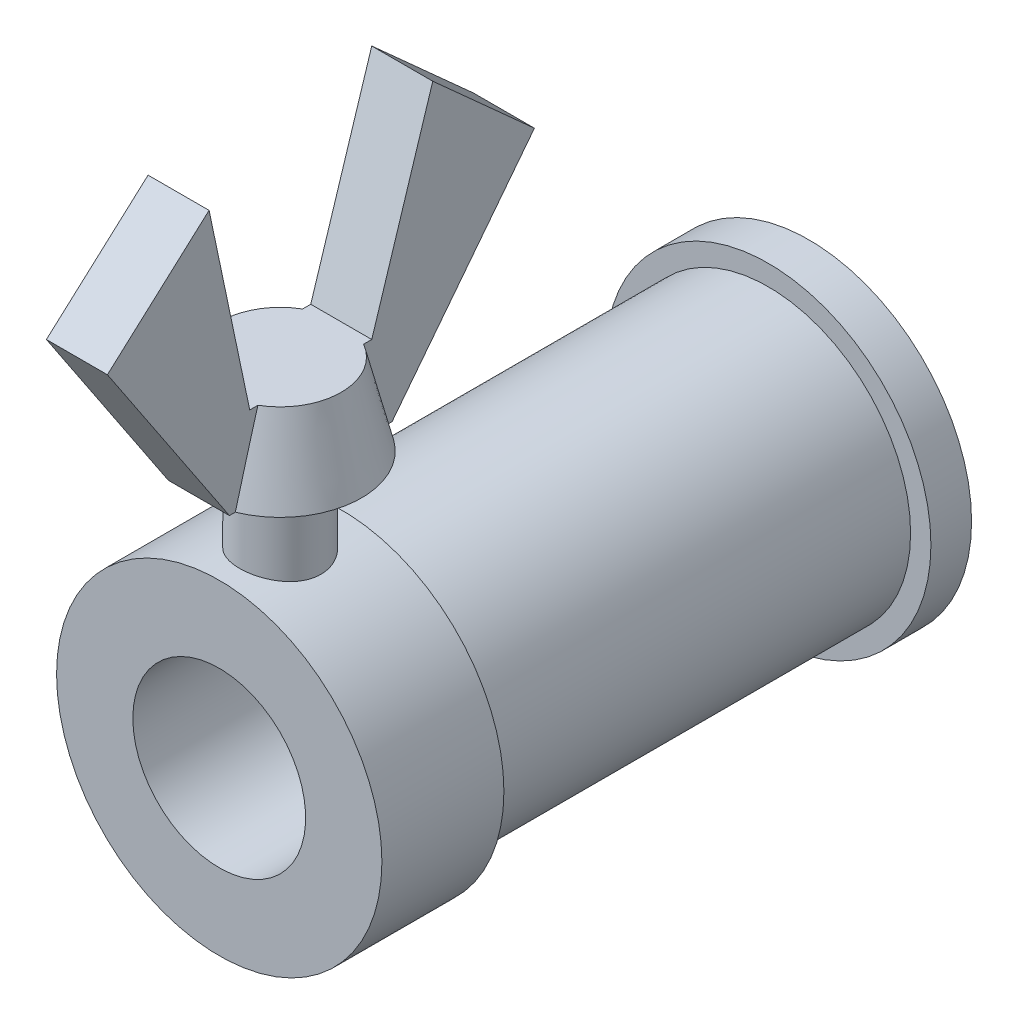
ISO-10303-21;
HEADER;
FILE_DESCRIPTION(('STEP AP214'),'2;1');
FILE_NAME('part.step','',(''),(''),'','','');
FILE_SCHEMA(('AUTOMOTIVE_DESIGN { 1 0 10303 214 1 1 1 1 }'));
ENDSEC;
DATA;
#1=APPLICATION_CONTEXT('core data for automotive mechanical design processes');
#2=APPLICATION_PROTOCOL_DEFINITION('international standard','automotive_design',2000,#1);
#3=PRODUCT_CONTEXT('',#1,'mechanical');
#4=PRODUCT('Part','Part','',(#3));
#5=PRODUCT_RELATED_PRODUCT_CATEGORY('part','',(#4));
#6=PRODUCT_DEFINITION_FORMATION('','',#4);
#7=PRODUCT_DEFINITION_CONTEXT('part definition',#1,'design');
#8=PRODUCT_DEFINITION('design','',#6,#7);
#9=PRODUCT_DEFINITION_SHAPE('','',#8);
#10=(LENGTH_UNIT() NAMED_UNIT(*) SI_UNIT(.MILLI.,.METRE.));
#11=(NAMED_UNIT(*) PLANE_ANGLE_UNIT() SI_UNIT($,.RADIAN.));
#12=(NAMED_UNIT(*) SI_UNIT($,.STERADIAN.) SOLID_ANGLE_UNIT());
#13=UNCERTAINTY_MEASURE_WITH_UNIT(LENGTH_MEASURE(1.E-05),#10,'distance_accuracy_value','');
#14=(GEOMETRIC_REPRESENTATION_CONTEXT(3) GLOBAL_UNCERTAINTY_ASSIGNED_CONTEXT((#13)) GLOBAL_UNIT_ASSIGNED_CONTEXT((#10,
#11,#12)) REPRESENTATION_CONTEXT('',''));
#15=CARTESIAN_POINT('',(0.,0.,0.));
#16=DIRECTION('',(0.,0.,1.));
#17=DIRECTION('',(1.,0.,0.));
#18=AXIS2_PLACEMENT_3D('',#15,#16,#17);
#19=CARTESIAN_POINT('',(0.,16.,26.));
#20=DIRECTION('',(0.,-1.,0.));
#21=DIRECTION('',(0.,0.,1.));
#22=AXIS2_PLACEMENT_3D('',#19,#20,#21);
#23=CONICAL_SURFACE('',#22,3.,0.244978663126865);
#24=CARTESIAN_POINT('',(-1.5,18.8634565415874,27.7225784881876));
#25=CARTESIAN_POINT('',(-1.5,18.7179564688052,27.7707943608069));
#26=CARTESIAN_POINT('',(-1.5,18.5722086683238,27.8182542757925));
#27=CARTESIAN_POINT('',(-1.5,18.2803109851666,27.9119099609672));
#28=CARTESIAN_POINT('',(-1.5,18.13416111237,27.9581057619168));
#29=CARTESIAN_POINT('',(-1.5,17.8415562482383,28.0494799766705));
#30=CARTESIAN_POINT('',(-1.5,17.6951012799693,28.0946584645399));
#31=CARTESIAN_POINT('',(-1.5,17.4019324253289,28.1841702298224));
#32=CARTESIAN_POINT('',(-1.5,17.2552185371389,28.2285035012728));
#33=CARTESIAN_POINT('',(-1.5,16.8148083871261,28.3604319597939));
#34=CARTESIAN_POINT('',(-1.5,16.5207956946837,28.4469706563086));
#35=CARTESIAN_POINT('',(-1.5,15.9321710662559,28.6179995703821));
#36=CARTESIAN_POINT('',(-1.5,15.6375591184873,28.7024897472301));
#37=CARTESIAN_POINT('',(-1.5,15.1572394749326,28.8388644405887));
#38=CARTESIAN_POINT('',(-1.5,14.9716653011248,28.8912200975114));
#39=CARTESIAN_POINT('',(-1.5,14.6003702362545,28.9954030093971));
#40=CARTESIAN_POINT('',(-1.5,14.4146493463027,29.0472302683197));
#41=CARTESIAN_POINT('',(-1.5,13.8572788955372,29.2020403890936));
#42=CARTESIAN_POINT('',(-1.5,13.4854412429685,29.3043460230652));
#43=CARTESIAN_POINT('',(-1.5,12.6318117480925,29.5375328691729));
#44=CARTESIAN_POINT('',(-1.5,12.1498946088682,29.6679546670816));
#45=CARTESIAN_POINT('',(-1.5,11.1856155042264,29.9271461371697));
#46=CARTESIAN_POINT('',(-1.5,10.7032535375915,30.0559158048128));
#47=CARTESIAN_POINT('',(-1.5,9.73827559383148,30.3121964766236));
#48=CARTESIAN_POINT('',(-1.5,9.25565966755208,30.439707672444));
#49=CARTESIAN_POINT('',(-1.5,8.29017561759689,30.6937568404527));
#50=CARTESIAN_POINT('',(-1.5,7.80730749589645,30.8202948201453));
#51=CARTESIAN_POINT('',(-1.5,7.32434773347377,30.9464797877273));
#52=B_SPLINE_CURVE_WITH_KNOTS('',3,(#24,#25,#26,#27,#28,#29,#30,#31,#32,#33,#34,#35,#36,#37,#38,
#39,#40,#41,#42,#43,#44,#45,#46,#47,#48,#49,#50,#51),.UNSPECIFIED.,.F.,.F.,(4,2,2,2,2,2,2,2,2,2,
2,2,2,4),(0.,0.459836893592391,0.919662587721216,1.37945469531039,1.83925004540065,
2.75869016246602,3.67814853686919,4.25660258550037,4.83505229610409,5.99201310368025,
7.4897692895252,8.9875295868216,10.4850581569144,11.982575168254),.UNSPECIFIED.);
#53=CARTESIAN_POINT('',(-1.5,16.,28.5980762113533));
#54=VERTEX_POINT('',#53);
#55=CARTESIAN_POINT('',(-1.5,12.,29.7080992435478));
#56=VERTEX_POINT('',#55);
#57=EDGE_CURVE('E308',#54,#56,#52,.T.);
#58=ORIENTED_EDGE('',*,*,#57,.F.);
#59=CARTESIAN_POINT('',(0.,16.,26.));
#60=DIRECTION('',(0.,-1.,0.));
#61=DIRECTION('',(0.,0.,1.));
#62=AXIS2_PLACEMENT_3D('',#59,#60,#61);
#63=CIRCLE('',#62,3.);
#64=CARTESIAN_POINT('',(-1.5,16.,23.4019237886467));
#65=VERTEX_POINT('',#64);
#66=EDGE_CURVE('E176',#54,#65,#63,.T.);
#67=ORIENTED_EDGE('',*,*,#66,.T.);
#68=CARTESIAN_POINT('',(-1.5,7.32434773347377,21.0535202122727));
#69=CARTESIAN_POINT('',(-1.5,7.80738804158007,21.1797262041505));
#70=CARTESIAN_POINT('',(-1.5,8.29033667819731,21.3062853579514));
#71=CARTESIAN_POINT('',(-1.5,9.25597170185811,21.5603746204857));
#72=CARTESIAN_POINT('',(-1.5,9.73865809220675,21.6879047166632));
#73=CARTESIAN_POINT('',(-1.5,10.7036262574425,21.9441835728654));
#74=CARTESIAN_POINT('',(-1.5,11.1859080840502,22.0729321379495));
#75=CARTESIAN_POINT('',(-1.5,12.1500361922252,22.3320837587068));
#76=CARTESIAN_POINT('',(-1.5,12.6318824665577,22.4624868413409));
#77=CARTESIAN_POINT('',(-1.5,13.5950544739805,22.7255967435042));
#78=CARTESIAN_POINT('',(-1.5,14.0763800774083,22.8583040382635));
#79=CARTESIAN_POINT('',(-1.5,15.038107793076,23.12697047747));
#80=CARTESIAN_POINT('',(-1.5,15.5185099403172,23.2629294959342));
#81=CARTESIAN_POINT('',(-1.5,16.2380729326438,23.4706495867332));
#82=CARTESIAN_POINT('',(-1.5,16.4777770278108,23.5405268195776));
#83=CARTESIAN_POINT('',(-1.5,16.9567027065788,23.6819038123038));
#84=CARTESIAN_POINT('',(-1.5,17.1959242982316,23.7534035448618));
#85=CARTESIAN_POINT('',(-1.5,17.6737573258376,23.898533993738));
#86=CARTESIAN_POINT('',(-1.5,17.9123686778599,23.972164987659));
#87=CARTESIAN_POINT('',(-1.5,18.2696087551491,24.0847837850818));
#88=CARTESIAN_POINT('',(-1.5,18.3885793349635,24.1226865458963));
#89=CARTESIAN_POINT('',(-1.5,18.62624120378,24.199363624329));
#90=CARTESIAN_POINT('',(-1.5,18.7449324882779,24.2381379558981));
#91=CARTESIAN_POINT('',(-1.5,18.8634565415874,24.2774215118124));
#92=B_SPLINE_CURVE_WITH_KNOTS('',3,(#68,#69,#70,#71,#72,#73,#74,#75,#76,#77,#78,#79,#80,#81,#82,
#83,#84,#85,#86,#87,#88,#89,#90,#91),.UNSPECIFIED.,.F.,.F.,(4,2,2,2,2,2,2,2,2,2,2,4),(0.,
1.49776676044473,2.99551418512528,4.49302590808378,5.99056206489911,7.48841083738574,
8.98620167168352,9.73524200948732,10.4842697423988,11.2333954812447,11.6079796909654,
11.9825699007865),.UNSPECIFIED.);
#93=CARTESIAN_POINT('',(-1.5,12.,22.2919007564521));
#94=VERTEX_POINT('',#93);
#95=EDGE_CURVE('E205',#94,#65,#92,.T.);
#96=ORIENTED_EDGE('',*,*,#95,.F.);
#97=CARTESIAN_POINT('',(0.,12.,26.));
#98=DIRECTION('',(0.,-1.,0.));
#99=DIRECTION('',(0.,0.,1.));
#100=AXIS2_PLACEMENT_3D('',#97,#98,#99);
#101=CIRCLE('',#100,4.);
#102=EDGE_CURVE('E174',#56,#94,#101,.T.);
#103=ORIENTED_EDGE('',*,*,#102,.F.);
#104=EDGE_LOOP('',(#58,#67,#96,#103));
#105=FACE_BOUND('',#104,.T.);
#106=ADVANCED_FACE('F14',(#105),#23,.T.);
#107=CARTESIAN_POINT('',(-8.,0.,0.));
#108=DIRECTION('',(0.,0.,1.));
#109=DIRECTION('',(1.,0.,0.));
#110=AXIS2_PLACEMENT_3D('',#107,#108,#109);
#111=PLANE('',#110);
#112=CARTESIAN_POINT('',(0.,0.,0.));
#113=DIRECTION('',(0.,0.,-1.));
#114=DIRECTION('',(-1.,0.,0.));
#115=AXIS2_PLACEMENT_3D('',#112,#113,#114);
#116=CIRCLE('',#115,4.25);
#117=CARTESIAN_POINT('',(-4.25,0.,0.));
#118=VERTEX_POINT('',#117);
#119=EDGE_CURVE('E181',#118,#118,#116,.T.);
#120=ORIENTED_EDGE('',*,*,#119,.F.);
#121=EDGE_LOOP('',(#120));
#122=FACE_BOUND('',#121,.T.);
#123=CARTESIAN_POINT('',(0.,0.,0.));
#124=DIRECTION('',(0.,0.,-1.));
#125=DIRECTION('',(-1.,0.,0.));
#126=AXIS2_PLACEMENT_3D('',#123,#124,#125);
#127=CIRCLE('',#126,8.);
#128=CARTESIAN_POINT('',(-8.,0.,0.));
#129=VERTEX_POINT('',#128);
#130=EDGE_CURVE('E202',#129,#129,#127,.T.);
#131=ORIENTED_EDGE('',*,*,#130,.T.);
#132=EDGE_LOOP('',(#131));
#133=FACE_BOUND('',#132,.T.);
#134=ADVANCED_FACE('F16',(#122,#133),#111,.F.);
#135=CARTESIAN_POINT('',(0.,0.,-31.));
#136=DIRECTION('',(0.,0.,-1.));
#137=DIRECTION('',(-1.,0.,0.));
#138=AXIS2_PLACEMENT_3D('',#135,#136,#137);
#139=CYLINDRICAL_SURFACE('',#138,8.);
#140=ORIENTED_EDGE('',*,*,#130,.F.);
#141=EDGE_LOOP('',(#140));
#142=FACE_BOUND('',#141,.T.);
#143=CARTESIAN_POINT('',(0.,0.,2.));
#144=DIRECTION('',(0.,0.,-1.));
#145=DIRECTION('',(-1.,0.,0.));
#146=AXIS2_PLACEMENT_3D('',#143,#144,#145);
#147=CIRCLE('',#146,8.);
#148=CARTESIAN_POINT('',(-8.,0.,2.));
#149=VERTEX_POINT('',#148);
#150=EDGE_CURVE('E199',#149,#149,#147,.T.);
#151=ORIENTED_EDGE('',*,*,#150,.T.);
#152=EDGE_LOOP('',(#151));
#153=FACE_BOUND('',#152,.T.);
#154=ADVANCED_FACE('F254',(#142,#153),#139,.T.);
#155=CARTESIAN_POINT('',(-7.,0.,2.));
#156=DIRECTION('',(0.,0.,-1.));
#157=DIRECTION('',(-1.,0.,0.));
#158=AXIS2_PLACEMENT_3D('',#155,#156,#157);
#159=PLANE('',#158);
#160=ORIENTED_EDGE('',*,*,#150,.F.);
#161=EDGE_LOOP('',(#160));
#162=FACE_BOUND('',#161,.T.);
#163=CARTESIAN_POINT('',(0.,0.,2.));
#164=DIRECTION('',(0.,0.,-1.));
#165=DIRECTION('',(-1.,0.,0.));
#166=AXIS2_PLACEMENT_3D('',#163,#164,#165);
#167=CIRCLE('',#166,7.);
#168=CARTESIAN_POINT('',(-7.,0.,2.));
#169=VERTEX_POINT('',#168);
#170=EDGE_CURVE('E196',#169,#169,#167,.T.);
#171=ORIENTED_EDGE('',*,*,#170,.T.);
#172=EDGE_LOOP('',(#171));
#173=FACE_BOUND('',#172,.T.);
#174=ADVANCED_FACE('F434',(#162,#173),#159,.F.);
#175=CARTESIAN_POINT('',(0.,0.,-31.));
#176=DIRECTION('',(0.,0.,-1.));
#177=DIRECTION('',(-1.,0.,0.));
#178=AXIS2_PLACEMENT_3D('',#175,#176,#177);
#179=CYLINDRICAL_SURFACE('',#178,7.);
#180=ORIENTED_EDGE('',*,*,#170,.F.);
#181=EDGE_LOOP('',(#180));
#182=FACE_BOUND('',#181,.T.);
#183=CARTESIAN_POINT('',(0.,0.,23.));
#184=DIRECTION('',(0.,0.,-1.));
#185=DIRECTION('',(-1.,0.,0.));
#186=AXIS2_PLACEMENT_3D('',#183,#184,#185);
#187=CIRCLE('',#186,7.);
#188=CARTESIAN_POINT('',(-7.,0.,23.));
#189=VERTEX_POINT('',#188);
#190=EDGE_CURVE('E193',#189,#189,#187,.T.);
#191=ORIENTED_EDGE('',*,*,#190,.T.);
#192=EDGE_LOOP('',(#191));
#193=FACE_BOUND('',#192,.T.);
#194=ADVANCED_FACE('F425',(#182,#193),#179,.T.);
#195=CARTESIAN_POINT('',(-8.,0.,23.));
#196=DIRECTION('',(0.,0.,1.));
#197=DIRECTION('',(1.,0.,0.));
#198=AXIS2_PLACEMENT_3D('',#195,#196,#197);
#199=PLANE('',#198);
#200=ORIENTED_EDGE('',*,*,#190,.F.);
#201=EDGE_LOOP('',(#200));
#202=FACE_BOUND('',#201,.T.);
#203=CARTESIAN_POINT('',(0.,0.,23.));
#204=DIRECTION('',(0.,0.,-1.));
#205=DIRECTION('',(-1.,0.,0.));
#206=AXIS2_PLACEMENT_3D('',#203,#204,#205);
#207=CIRCLE('',#206,8.);
#208=CARTESIAN_POINT('',(-8.,0.,23.));
#209=VERTEX_POINT('',#208);
#210=EDGE_CURVE('E190',#209,#209,#207,.T.);
#211=ORIENTED_EDGE('',*,*,#210,.T.);
#212=EDGE_LOOP('',(#211));
#213=FACE_BOUND('',#212,.T.);
#214=ADVANCED_FACE('F244',(#202,#213),#199,.F.);
#215=CARTESIAN_POINT('',(0.,0.,-31.));
#216=DIRECTION('',(0.,0.,-1.));
#217=DIRECTION('',(-1.,0.,0.));
#218=AXIS2_PLACEMENT_3D('',#215,#216,#217);
#219=CYLINDRICAL_SURFACE('',#218,8.);
#220=CARTESIAN_POINT('',(0.,8.,28.));
#221=CARTESIAN_POINT('',(-0.110501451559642,7.99999813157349,27.9999968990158));
#222=CARTESIAN_POINT('',(-0.221037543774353,7.99768770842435,27.990811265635));
#223=CARTESIAN_POINT('',(-0.438941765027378,7.98869485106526,27.954366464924));
#224=CARTESIAN_POINT('',(-0.546308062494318,7.98200993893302,27.9270970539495));
#225=CARTESIAN_POINT('',(-0.754694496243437,7.96500835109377,27.8554143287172));
#226=CARTESIAN_POINT('',(-0.855722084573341,7.95469603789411,27.811021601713));
#227=CARTESIAN_POINT('',(-1.04889617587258,7.93153791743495,27.7064248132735));
#228=CARTESIAN_POINT('',(-1.14104237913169,7.91869202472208,27.646220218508));
#229=CARTESIAN_POINT('',(-1.31573590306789,7.89156551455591,27.5103989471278));
#230=CARTESIAN_POINT('',(-1.39807425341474,7.87726276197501,27.4345179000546));
#231=CARTESIAN_POINT('',(-1.54899856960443,7.84898160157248,27.270063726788));
#232=CARTESIAN_POINT('',(-1.61758298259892,7.83500323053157,27.1814891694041));
#233=CARTESIAN_POINT('',(-1.74003539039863,7.80873034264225,26.992539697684));
#234=CARTESIAN_POINT('',(-1.79366962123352,7.79646392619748,26.8920090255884));
#235=CARTESIAN_POINT('',(-1.88319587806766,7.77532659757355,26.6830021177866));
#236=CARTESIAN_POINT('',(-1.91909074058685,7.76645514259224,26.5745271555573));
#237=CARTESIAN_POINT('',(-1.97140644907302,7.7533396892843,26.3550086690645));
#238=CARTESIAN_POINT('',(-1.98820302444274,7.74900654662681,26.244060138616));
#239=CARTESIAN_POINT('',(-2.00301570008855,7.74519149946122,26.0208419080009));
#240=CARTESIAN_POINT('',(-2.00103485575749,7.74570880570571,25.9085724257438));
#241=CARTESIAN_POINT('',(-1.97864869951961,7.75145607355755,25.6887789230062));
#242=CARTESIAN_POINT('',(-1.95869112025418,7.75657150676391,25.5812058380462));
#243=CARTESIAN_POINT('',(-1.90163224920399,7.77075612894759,25.3709852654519));
#244=CARTESIAN_POINT('',(-1.86452973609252,7.77982559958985,25.2683381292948));
#245=CARTESIAN_POINT('',(-1.77385263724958,7.80100151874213,25.0696826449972));
#246=CARTESIAN_POINT('',(-1.72011555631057,7.81313769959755,24.9737517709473));
#247=CARTESIAN_POINT('',(-1.59780836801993,7.83906281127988,24.7921083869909));
#248=CARTESIAN_POINT('',(-1.52923566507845,7.85285203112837,24.7063976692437));
#249=CARTESIAN_POINT('',(-1.37688456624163,7.88101174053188,24.5450618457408));
#250=CARTESIAN_POINT('',(-1.29272834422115,7.89538759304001,24.4697940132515));
#251=CARTESIAN_POINT('',(-1.11281589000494,7.92274620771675,24.3343716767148));
#252=CARTESIAN_POINT('',(-1.01705930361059,7.93572892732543,24.2742176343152));
#253=CARTESIAN_POINT('',(-0.816154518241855,7.9589030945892,24.1705992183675));
#254=CARTESIAN_POINT('',(-0.710975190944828,7.96908480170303,24.1271928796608));
#255=CARTESIAN_POINT('',(-0.494501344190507,7.98543889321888,24.0587769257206));
#256=CARTESIAN_POINT('',(-0.383207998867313,7.99161204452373,24.0337637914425));
#257=CARTESIAN_POINT('',(-0.160719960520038,7.999139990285,24.0033899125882));
#258=CARTESIAN_POINT('',(-0.049595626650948,8.00061404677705,23.9975426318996));
#259=CARTESIAN_POINT('',(0.172043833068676,7.99891739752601,24.0043320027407));
#260=CARTESIAN_POINT('',(0.282559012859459,7.99574710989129,24.0169669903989));
#261=CARTESIAN_POINT('',(0.498152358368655,7.98519441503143,24.0599612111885));
#262=CARTESIAN_POINT('',(0.603286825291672,7.97787512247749,24.0900550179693));
#263=CARTESIAN_POINT('',(0.807009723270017,7.95984942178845,24.1668094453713));
#264=CARTESIAN_POINT('',(0.905597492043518,7.94914267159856,24.2134717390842));
#265=CARTESIAN_POINT('',(1.0953641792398,7.92524410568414,24.3229815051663));
#266=CARTESIAN_POINT('',(1.18638058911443,7.91201156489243,24.3861014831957));
#267=CARTESIAN_POINT('',(1.35670215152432,7.88459345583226,24.5263865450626));
#268=CARTESIAN_POINT('',(1.43600527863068,7.87040772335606,24.6035540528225));
#269=CARTESIAN_POINT('',(1.58265409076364,7.84225275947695,24.7720026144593));
#270=CARTESIAN_POINT('',(1.6496584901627,7.82829738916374,24.8635836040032));
#271=CARTESIAN_POINT('',(1.76734767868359,7.80257171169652,25.0569768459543));
#272=CARTESIAN_POINT('',(1.81803319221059,7.79080130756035,25.1587886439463));
#273=CARTESIAN_POINT('',(1.90126856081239,7.77090792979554,25.3692076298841));
#274=CARTESIAN_POINT('',(1.93392586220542,7.76276340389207,25.4777701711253));
#275=CARTESIAN_POINT('',(1.98046087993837,7.75102325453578,25.6990795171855));
#276=CARTESIAN_POINT('',(1.99434270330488,7.74742663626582,25.8118254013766));
#277=CARTESIAN_POINT('',(2.00271812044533,7.74526534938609,26.0348280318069));
#278=CARTESIAN_POINT('',(1.99775719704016,7.74655910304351,26.145063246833));
#279=CARTESIAN_POINT('',(1.96983637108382,7.7537054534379,26.3630718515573));
#280=CARTESIAN_POINT('',(1.94687683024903,7.75955795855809,26.4708452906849));
#281=CARTESIAN_POINT('',(1.88390842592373,7.77508347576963,26.6802779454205));
#282=CARTESIAN_POINT('',(1.84400187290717,7.78473353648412,26.7819697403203));
#283=CARTESIAN_POINT('',(1.7483532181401,7.80677007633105,26.9772871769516));
#284=CARTESIAN_POINT('',(1.69260892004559,7.81915693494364,27.0709116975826));
#285=CARTESIAN_POINT('',(1.56515699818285,7.84567512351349,27.2500728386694));
#286=CARTESIAN_POINT('',(1.493070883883,7.85984353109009,27.3353347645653));
#287=CARTESIAN_POINT('',(1.33571916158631,7.88810702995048,27.4927293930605));
#288=CARTESIAN_POINT('',(1.25045042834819,7.90220210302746,27.564858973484));
#289=CARTESIAN_POINT('',(1.06729011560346,7.9290354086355,27.6952150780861));
#290=CARTESIAN_POINT('',(0.969197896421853,7.94174444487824,27.7531661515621));
#291=CARTESIAN_POINT('',(0.764354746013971,7.96406566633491,27.8516632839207));
#292=CARTESIAN_POINT('',(0.657610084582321,7.97368006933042,27.892221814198));
#293=CARTESIAN_POINT('',(0.459213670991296,7.98730746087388,27.9487624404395));
#294=CARTESIAN_POINT('',(0.368506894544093,7.9920344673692,27.9679349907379));
#295=CARTESIAN_POINT('',(0.185208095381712,7.99838140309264,27.9935545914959));
#296=CARTESIAN_POINT('',(0.0926162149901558,8.00000156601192,28.0000025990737));
#297=CARTESIAN_POINT('',(0.,8.,28.));
#298=B_SPLINE_CURVE_WITH_KNOTS('',3,(#220,#221,#222,#223,#224,#225,#226,#227,#228,#229,#230,
#231,#232,#233,#234,#235,#236,#237,#238,#239,#240,#241,#242,#243,#244,#245,#246,#247,#248,#249,
#250,#251,#252,#253,#254,#255,#256,#257,#258,#259,#260,#261,#262,#263,#264,#265,#266,#267,#268,
#269,#270,#271,#272,#273,#274,#275,#276,#277,#278,#279,#280,#281,#282,#283,#284,#285,#286,#287,
#288,#289,#290,#291,#292,#293,#294,#295,#296,#297),.UNSPECIFIED.,.T.,.F.,(4,2,2,2,2,2,2,2,2,2,2,
2,2,2,2,2,2,2,2,2,2,2,2,2,2,2,2,2,2,2,2,2,2,2,2,2,2,2,4),(0.,0.331164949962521,0.66251765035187,
0.993473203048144,1.32443992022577,1.66152580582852,1.99864972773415,2.34078196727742,
2.68285948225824,3.01808393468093,3.3532538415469,3.68029996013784,4.00736937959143,
4.33774037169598,4.6681692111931,5.00802001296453,5.34788119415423,5.6889097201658,
6.02987298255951,6.36211078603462,6.69431868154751,7.02160366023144,7.34892169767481,
7.68204783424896,8.01523150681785,8.35659345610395,8.6979402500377,9.03723006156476,
9.37644564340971,9.70591707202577,10.0353818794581,10.3628853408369,10.6904342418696,
11.0265276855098,11.3627009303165,11.7049624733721,12.0469781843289,12.3245632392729,
12.6021274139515),.UNSPECIFIED.);
#299=CARTESIAN_POINT('',(0.,8.,28.));
#300=VERTEX_POINT('',#299);
#301=EDGE_CURVE('E180',#300,#300,#298,.T.);
#302=ORIENTED_EDGE('',*,*,#301,.T.);
#303=EDGE_LOOP('',(#302));
#304=FACE_BOUND('',#303,.T.);
#305=ORIENTED_EDGE('',*,*,#210,.F.);
#306=EDGE_LOOP('',(#305));
#307=FACE_BOUND('',#306,.T.);
#308=CARTESIAN_POINT('',(0.,0.,29.));
#309=DIRECTION('',(0.,0.,-1.));
#310=DIRECTION('',(-1.,0.,0.));
#311=AXIS2_PLACEMENT_3D('',#308,#309,#310);
#312=CIRCLE('',#311,8.);
#313=CARTESIAN_POINT('',(-8.,0.,29.));
#314=VERTEX_POINT('',#313);
#315=EDGE_CURVE('E187',#314,#314,#312,.T.);
#316=ORIENTED_EDGE('',*,*,#315,.T.);
#317=EDGE_LOOP('',(#316));
#318=FACE_BOUND('',#317,.T.);
#319=ADVANCED_FACE('F219',(#304,#307,#318),#219,.T.);
#320=CARTESIAN_POINT('',(-4.25,0.,29.));
#321=DIRECTION('',(0.,0.,-1.));
#322=DIRECTION('',(-1.,0.,0.));
#323=AXIS2_PLACEMENT_3D('',#320,#321,#322);
#324=PLANE('',#323);
#325=ORIENTED_EDGE('',*,*,#315,.F.);
#326=EDGE_LOOP('',(#325));
#327=FACE_BOUND('',#326,.T.);
#328=CARTESIAN_POINT('',(0.,0.,29.));
#329=DIRECTION('',(0.,0.,-1.));
#330=DIRECTION('',(-1.,0.,0.));
#331=AXIS2_PLACEMENT_3D('',#328,#329,#330);
#332=CIRCLE('',#331,4.25);
#333=CARTESIAN_POINT('',(-4.25,0.,29.));
#334=VERTEX_POINT('',#333);
#335=EDGE_CURVE('E184',#334,#334,#332,.T.);
#336=ORIENTED_EDGE('',*,*,#335,.T.);
#337=EDGE_LOOP('',(#336));
#338=FACE_BOUND('',#337,.T.);
#339=ADVANCED_FACE('F236',(#327,#338),#324,.F.);
#340=CARTESIAN_POINT('',(0.,0.,-31.));
#341=DIRECTION('',(0.,0.,-1.));
#342=DIRECTION('',(-1.,0.,0.));
#343=AXIS2_PLACEMENT_3D('',#340,#341,#342);
#344=CYLINDRICAL_SURFACE('',#343,4.25);
#345=ORIENTED_EDGE('',*,*,#335,.F.);
#346=EDGE_LOOP('',(#345));
#347=FACE_BOUND('',#346,.T.);
#348=ORIENTED_EDGE('',*,*,#119,.T.);
#349=EDGE_LOOP('',(#348));
#350=FACE_BOUND('',#349,.T.);
#351=ADVANCED_FACE('F229',(#347,#350),#344,.F.);
#352=CARTESIAN_POINT('',(0.,-40.,26.));
#353=DIRECTION('',(0.,-1.,0.));
#354=DIRECTION('',(0.,0.,1.));
#355=AXIS2_PLACEMENT_3D('',#352,#353,#354);
#356=CYLINDRICAL_SURFACE('',#355,2.);
#357=CARTESIAN_POINT('',(0.,12.,26.));
#358=DIRECTION('',(0.,-1.,0.));
#359=DIRECTION('',(0.,0.,1.));
#360=AXIS2_PLACEMENT_3D('',#357,#358,#359);
#361=CIRCLE('',#360,2.);
#362=CARTESIAN_POINT('',(0.,12.,28.));
#363=VERTEX_POINT('',#362);
#364=EDGE_CURVE('E177',#363,#363,#361,.T.);
#365=ORIENTED_EDGE('',*,*,#364,.T.);
#366=EDGE_LOOP('',(#365));
#367=FACE_BOUND('',#366,.T.);
#368=ORIENTED_EDGE('',*,*,#301,.F.);
#369=EDGE_LOOP('',(#368));
#370=FACE_BOUND('',#369,.T.);
#371=ADVANCED_FACE('F223',(#367,#370),#356,.T.);
#372=CARTESIAN_POINT('',(0.,12.,22.));
#373=DIRECTION('',(0.,1.,0.));
#374=DIRECTION('',(0.,0.,-1.));
#375=AXIS2_PLACEMENT_3D('',#372,#373,#374);
#376=PLANE('',#375);
#377=ORIENTED_EDGE('',*,*,#364,.F.);
#378=EDGE_LOOP('',(#377));
#379=FACE_BOUND('',#378,.T.);
#380=CARTESIAN_POINT('',(1.5,12.,22.2919007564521));
#381=VERTEX_POINT('',#380);
#382=CARTESIAN_POINT('',(1.5,12.,29.7080992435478));
#383=VERTEX_POINT('',#382);
#384=EDGE_CURVE('E116',#381,#383,#101,.T.);
#385=ORIENTED_EDGE('',*,*,#384,.T.);
#386=DIRECTION('',(0.,0.,1.));
#387=VECTOR('',#386,1.);
#388=CARTESIAN_POINT('',(1.5,12.,22.));
#389=LINE('',#388,#387);
#390=CARTESIAN_POINT('',(1.5,12.,30.));
#391=VERTEX_POINT('',#390);
#392=EDGE_CURVE('E132',#383,#391,#389,.T.);
#393=ORIENTED_EDGE('',*,*,#392,.T.);
#394=DIRECTION('',(1.,0.,0.));
#395=VECTOR('',#394,1.);
#396=CARTESIAN_POINT('',(-1.5,12.,30.));
#397=LINE('',#396,#395);
#398=CARTESIAN_POINT('',(-1.5,12.,30.));
#399=VERTEX_POINT('',#398);
#400=EDGE_CURVE('E167',#399,#391,#397,.T.);
#401=ORIENTED_EDGE('',*,*,#400,.F.);
#402=DIRECTION('',(0.,0.,1.));
#403=VECTOR('',#402,1.);
#404=CARTESIAN_POINT('',(-1.5,12.,22.));
#405=LINE('',#404,#403);
#406=EDGE_CURVE('E152',#56,#399,#405,.T.);
#407=ORIENTED_EDGE('',*,*,#406,.F.);
#408=ORIENTED_EDGE('',*,*,#102,.T.);
#409=CARTESIAN_POINT('',(-1.5,12.,22.));
#410=VERTEX_POINT('',#409);
#411=EDGE_CURVE('E149',#410,#94,#405,.T.);
#412=ORIENTED_EDGE('',*,*,#411,.F.);
#413=DIRECTION('',(1.,0.,0.));
#414=VECTOR('',#413,1.);
#415=CARTESIAN_POINT('',(-1.5,12.,22.));
#416=LINE('',#415,#414);
#417=CARTESIAN_POINT('',(1.5,12.,22.));
#418=VERTEX_POINT('',#417);
#419=EDGE_CURVE('E169',#410,#418,#416,.T.);
#420=ORIENTED_EDGE('',*,*,#419,.T.);
#421=EDGE_CURVE('E283',#418,#381,#389,.T.);
#422=ORIENTED_EDGE('',*,*,#421,.T.);
#423=EDGE_LOOP('',(#385,#393,#401,#407,#408,#412,#420,#422));
#424=FACE_BOUND('',#423,.T.);
#425=ADVANCED_FACE('F228',(#379,#424),#376,.F.);
#426=CARTESIAN_POINT('',(0.,16.,23.));
#427=DIRECTION('',(0.,1.,0.));
#428=DIRECTION('',(0.,0.,-1.));
#429=AXIS2_PLACEMENT_3D('',#426,#427,#428);
#430=PLANE('',#429);
#431=CARTESIAN_POINT('',(1.5,16.,23.4019237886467));
#432=VERTEX_POINT('',#431);
#433=CARTESIAN_POINT('',(1.5,16.,28.5980762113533));
#434=VERTEX_POINT('',#433);
#435=EDGE_CURVE('E34',#432,#434,#63,.T.);
#436=ORIENTED_EDGE('',*,*,#435,.F.);
#437=DIRECTION('',(0.,0.,1.));
#438=VECTOR('',#437,1.);
#439=CARTESIAN_POINT('',(1.5,16.,23.));
#440=LINE('',#439,#438);
#441=CARTESIAN_POINT('',(1.5,16.,23.));
#442=VERTEX_POINT('',#441);
#443=EDGE_CURVE('E159',#442,#432,#440,.T.);
#444=ORIENTED_EDGE('',*,*,#443,.F.);
#445=DIRECTION('',(1.,0.,0.));
#446=VECTOR('',#445,1.);
#447=CARTESIAN_POINT('',(-1.5,16.,23.));
#448=LINE('',#447,#446);
#449=CARTESIAN_POINT('',(-1.5,16.,23.));
#450=VERTEX_POINT('',#449);
#451=EDGE_CURVE('E122',#450,#442,#448,.T.);
#452=ORIENTED_EDGE('',*,*,#451,.F.);
#453=DIRECTION('',(0.,0.,1.));
#454=VECTOR('',#453,1.);
#455=CARTESIAN_POINT('',(-1.5,16.,23.));
#456=LINE('',#455,#454);
#457=EDGE_CURVE('E136',#450,#65,#456,.T.);
#458=ORIENTED_EDGE('',*,*,#457,.T.);
#459=ORIENTED_EDGE('',*,*,#66,.F.);
#460=CARTESIAN_POINT('',(-1.5,16.,29.));
#461=VERTEX_POINT('',#460);
#462=EDGE_CURVE('E139',#54,#461,#456,.T.);
#463=ORIENTED_EDGE('',*,*,#462,.T.);
#464=DIRECTION('',(1.,0.,0.));
#465=VECTOR('',#464,1.);
#466=CARTESIAN_POINT('',(-1.5,16.,29.));
#467=LINE('',#466,#465);
#468=CARTESIAN_POINT('',(1.5,16.,29.));
#469=VERTEX_POINT('',#468);
#470=EDGE_CURVE('E161',#461,#469,#467,.T.);
#471=ORIENTED_EDGE('',*,*,#470,.T.);
#472=EDGE_CURVE('E271',#434,#469,#440,.T.);
#473=ORIENTED_EDGE('',*,*,#472,.F.);
#474=EDGE_LOOP('',(#436,#444,#452,#458,#459,#463,#471,#473));
#475=FACE_BOUND('',#474,.T.);
#476=ADVANCED_FACE('F231',(#475),#430,.T.);
#477=ORIENTED_EDGE('',*,*,#435,.T.);
#478=CARTESIAN_POINT('',(1.5,18.8634565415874,27.7225784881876));
#479=CARTESIAN_POINT('',(1.5,18.7179564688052,27.7707943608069));
#480=CARTESIAN_POINT('',(1.5,18.5722086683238,27.8182542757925));
#481=CARTESIAN_POINT('',(1.5,18.2803109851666,27.9119099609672));
#482=CARTESIAN_POINT('',(1.5,18.13416111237,27.9581057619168));
#483=CARTESIAN_POINT('',(1.5,17.8415562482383,28.0494799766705));
#484=CARTESIAN_POINT('',(1.5,17.6951012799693,28.0946584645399));
#485=CARTESIAN_POINT('',(1.5,17.4019324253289,28.1841702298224));
#486=CARTESIAN_POINT('',(1.5,17.2552185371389,28.2285035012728));
#487=CARTESIAN_POINT('',(1.5,16.8148083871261,28.3604319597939));
#488=CARTESIAN_POINT('',(1.5,16.5207956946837,28.4469706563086));
#489=CARTESIAN_POINT('',(1.5,15.9321710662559,28.6179995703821));
#490=CARTESIAN_POINT('',(1.5,15.6375591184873,28.7024897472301));
#491=CARTESIAN_POINT('',(1.5,15.1572394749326,28.8388644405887));
#492=CARTESIAN_POINT('',(1.5,14.9716653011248,28.8912200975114));
#493=CARTESIAN_POINT('',(1.5,14.6003702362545,28.9954030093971));
#494=CARTESIAN_POINT('',(1.5,14.4146493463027,29.0472302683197));
#495=CARTESIAN_POINT('',(1.5,13.8572788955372,29.2020403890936));
#496=CARTESIAN_POINT('',(1.5,13.4854412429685,29.3043460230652));
#497=CARTESIAN_POINT('',(1.5,12.6318117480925,29.5375328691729));
#498=CARTESIAN_POINT('',(1.5,12.1498946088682,29.6679546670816));
#499=CARTESIAN_POINT('',(1.5,11.1856155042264,29.9271461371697));
#500=CARTESIAN_POINT('',(1.5,10.7032535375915,30.0559158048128));
#501=CARTESIAN_POINT('',(1.5,9.73827559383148,30.3121964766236));
#502=CARTESIAN_POINT('',(1.5,9.25565966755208,30.439707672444));
#503=CARTESIAN_POINT('',(1.5,8.29017561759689,30.6937568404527));
#504=CARTESIAN_POINT('',(1.5,7.80730749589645,30.8202948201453));
#505=CARTESIAN_POINT('',(1.5,7.32434773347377,30.9464797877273));
#506=B_SPLINE_CURVE_WITH_KNOTS('',3,(#478,#479,#480,#481,#482,#483,#484,#485,#486,#487,#488,
#489,#490,#491,#492,#493,#494,#495,#496,#497,#498,#499,#500,#501,#502,#503,#504,#505),
.UNSPECIFIED.,.F.,.F.,(4,2,2,2,2,2,2,2,2,2,2,2,2,4),(0.,0.459836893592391,0.919662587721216,
1.37945469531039,1.83925004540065,2.75869016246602,3.67814853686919,4.25660258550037,
4.83505229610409,5.99201310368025,7.4897692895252,8.9875295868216,10.4850581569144,
11.982575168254),.UNSPECIFIED.);
#507=EDGE_CURVE('E9',#434,#383,#506,.T.);
#508=ORIENTED_EDGE('',*,*,#507,.T.);
#509=ORIENTED_EDGE('',*,*,#384,.F.);
#510=CARTESIAN_POINT('',(1.5,7.32434773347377,21.0535202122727));
#511=CARTESIAN_POINT('',(1.5,7.80738804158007,21.1797262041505));
#512=CARTESIAN_POINT('',(1.5,8.29033667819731,21.3062853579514));
#513=CARTESIAN_POINT('',(1.5,9.25597170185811,21.5603746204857));
#514=CARTESIAN_POINT('',(1.5,9.73865809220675,21.6879047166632));
#515=CARTESIAN_POINT('',(1.5,10.7036262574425,21.9441835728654));
#516=CARTESIAN_POINT('',(1.5,11.1859080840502,22.0729321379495));
#517=CARTESIAN_POINT('',(1.5,12.1500361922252,22.3320837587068));
#518=CARTESIAN_POINT('',(1.5,12.6318824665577,22.4624868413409));
#519=CARTESIAN_POINT('',(1.5,13.5950544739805,22.7255967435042));
#520=CARTESIAN_POINT('',(1.5,14.0763800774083,22.8583040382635));
#521=CARTESIAN_POINT('',(1.5,15.038107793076,23.12697047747));
#522=CARTESIAN_POINT('',(1.5,15.5185099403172,23.2629294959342));
#523=CARTESIAN_POINT('',(1.5,16.2380729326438,23.4706495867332));
#524=CARTESIAN_POINT('',(1.5,16.4777770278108,23.5405268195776));
#525=CARTESIAN_POINT('',(1.5,16.9567027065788,23.6819038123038));
#526=CARTESIAN_POINT('',(1.5,17.1959242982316,23.7534035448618));
#527=CARTESIAN_POINT('',(1.5,17.6737573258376,23.898533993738));
#528=CARTESIAN_POINT('',(1.5,17.9123686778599,23.972164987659));
#529=CARTESIAN_POINT('',(1.5,18.2696087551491,24.0847837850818));
#530=CARTESIAN_POINT('',(1.5,18.3885793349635,24.1226865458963));
#531=CARTESIAN_POINT('',(1.5,18.62624120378,24.199363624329));
#532=CARTESIAN_POINT('',(1.5,18.7449324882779,24.2381379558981));
#533=CARTESIAN_POINT('',(1.5,18.8634565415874,24.2774215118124));
#534=B_SPLINE_CURVE_WITH_KNOTS('',3,(#510,#511,#512,#513,#514,#515,#516,#517,#518,#519,#520,
#521,#522,#523,#524,#525,#526,#527,#528,#529,#530,#531,#532,#533),.UNSPECIFIED.,.F.,.F.,(4,2,2,
2,2,2,2,2,2,2,2,4),(0.,1.49776676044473,2.99551418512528,4.49302590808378,5.99056206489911,
7.48841083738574,8.98620167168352,9.73524200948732,10.4842697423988,11.2333954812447,
11.6079796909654,11.9825699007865),.UNSPECIFIED.);
#535=EDGE_CURVE('E28',#381,#432,#534,.T.);
#536=ORIENTED_EDGE('',*,*,#535,.T.);
#537=EDGE_LOOP('',(#477,#508,#509,#536));
#538=FACE_BOUND('',#537,.T.);
#539=ADVANCED_FACE('F250',(#538),#23,.T.);
#540=CARTESIAN_POINT('',(-1.5,12.,22.));
#541=DIRECTION('',(0.,-0.61394061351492,-0.789352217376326));
#542=DIRECTION('',(0.,-0.789352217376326,0.61394061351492));
#543=AXIS2_PLACEMENT_3D('',#540,#541,#542);
#544=PLANE('',#543);
#545=ORIENTED_EDGE('',*,*,#419,.F.);
#546=DIRECTION('',(0.,0.789352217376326,-0.61394061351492));
#547=VECTOR('',#546,1.);
#548=CARTESIAN_POINT('',(-1.5,12.,22.));
#549=LINE('',#548,#547);
#550=CARTESIAN_POINT('',(-1.5,21.,15.));
#551=VERTEX_POINT('',#550);
#552=EDGE_CURVE('E153',#410,#551,#549,.T.);
#553=ORIENTED_EDGE('',*,*,#552,.T.);
#554=DIRECTION('',(1.,0.,0.));
#555=VECTOR('',#554,1.);
#556=CARTESIAN_POINT('',(-1.5,21.,15.));
#557=LINE('',#556,#555);
#558=CARTESIAN_POINT('',(1.5,21.,15.));
#559=VERTEX_POINT('',#558);
#560=EDGE_CURVE('E117',#551,#559,#557,.T.);
#561=ORIENTED_EDGE('',*,*,#560,.T.);
#562=DIRECTION('',(0.,0.789352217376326,-0.61394061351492));
#563=VECTOR('',#562,1.);
#564=CARTESIAN_POINT('',(1.5,12.,22.));
#565=LINE('',#564,#563);
#566=EDGE_CURVE('E130',#418,#559,#565,.T.);
#567=ORIENTED_EDGE('',*,*,#566,.F.);
#568=EDGE_LOOP('',(#545,#553,#561,#567));
#569=FACE_BOUND('',#568,.T.);
#570=ADVANCED_FACE('F259',(#569),#544,.T.);
#571=CARTESIAN_POINT('',(-1.5,21.,15.));
#572=DIRECTION('',(0.,0.743294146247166,-0.66896473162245));
#573=DIRECTION('',(0.,-0.66896473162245,-0.743294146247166));
#574=AXIS2_PLACEMENT_3D('',#571,#572,#573);
#575=PLANE('',#574);
#576=ORIENTED_EDGE('',*,*,#560,.F.);
#577=DIRECTION('',(0.,0.66896473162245,0.743294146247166));
#578=VECTOR('',#577,1.);
#579=CARTESIAN_POINT('',(-1.5,21.,15.));
#580=LINE('',#579,#578);
#581=CARTESIAN_POINT('',(-1.5,25.5,20.));
#582=VERTEX_POINT('',#581);
#583=EDGE_CURVE('E112',#551,#582,#580,.T.);
#584=ORIENTED_EDGE('',*,*,#583,.T.);
#585=DIRECTION('',(1.,0.,0.));
#586=VECTOR('',#585,1.);
#587=CARTESIAN_POINT('',(-1.5,25.5,20.));
#588=LINE('',#587,#586);
#589=CARTESIAN_POINT('',(1.5,25.5,20.));
#590=VERTEX_POINT('',#589);
#591=EDGE_CURVE('E105',#582,#590,#588,.T.);
#592=ORIENTED_EDGE('',*,*,#591,.T.);
#593=DIRECTION('',(0.,0.66896473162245,0.743294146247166));
#594=VECTOR('',#593,1.);
#595=CARTESIAN_POINT('',(1.5,21.,15.));
#596=LINE('',#595,#594);
#597=EDGE_CURVE('E109',#559,#590,#596,.T.);
#598=ORIENTED_EDGE('',*,*,#597,.F.);
#599=EDGE_LOOP('',(#576,#584,#592,#598));
#600=FACE_BOUND('',#599,.T.);
#601=ADVANCED_FACE('F107',(#600),#575,.T.);
#602=CARTESIAN_POINT('',(1.5,12.,24.2631578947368));
#603=DIRECTION('',(1.,0.,0.));
#604=DIRECTION('',(0.,0.,-1.));
#605=AXIS2_PLACEMENT_3D('',#602,#603,#604);
#606=PLANE('',#605);
#607=ORIENTED_EDGE('',*,*,#535,.F.);
#608=ORIENTED_EDGE('',*,*,#421,.F.);
#609=ORIENTED_EDGE('',*,*,#566,.T.);
#610=ORIENTED_EDGE('',*,*,#597,.T.);
#611=DIRECTION('',(0.,0.953582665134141,-0.301131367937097));
#612=VECTOR('',#611,1.);
#613=CARTESIAN_POINT('',(1.5,16.,23.));
#614=LINE('',#613,#612);
#615=EDGE_CURVE('E120',#442,#590,#614,.T.);
#616=ORIENTED_EDGE('',*,*,#615,.F.);
#617=ORIENTED_EDGE('',*,*,#443,.T.);
#618=EDGE_LOOP('',(#607,#608,#609,#610,#616,#617));
#619=FACE_BOUND('',#618,.T.);
#620=ADVANCED_FACE('F127',(#619),#606,.T.);
#621=CARTESIAN_POINT('',(-1.5,16.,23.));
#622=DIRECTION('',(0.,-0.301131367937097,-0.953582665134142));
#623=DIRECTION('',(0.,-0.953582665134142,0.301131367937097));
#624=AXIS2_PLACEMENT_3D('',#621,#622,#623);
#625=PLANE('',#624);
#626=ORIENTED_EDGE('',*,*,#591,.F.);
#627=DIRECTION('',(0.,0.953582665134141,-0.301131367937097));
#628=VECTOR('',#627,1.);
#629=CARTESIAN_POINT('',(-1.5,16.,23.));
#630=LINE('',#629,#628);
#631=EDGE_CURVE('E157',#450,#582,#630,.T.);
#632=ORIENTED_EDGE('',*,*,#631,.F.);
#633=ORIENTED_EDGE('',*,*,#451,.T.);
#634=ORIENTED_EDGE('',*,*,#615,.T.);
#635=EDGE_LOOP('',(#626,#632,#633,#634));
#636=FACE_BOUND('',#635,.T.);
#637=ADVANCED_FACE('F121',(#636),#625,.F.);
#638=CARTESIAN_POINT('',(-1.5,12.,24.2631578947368));
#639=DIRECTION('',(1.,0.,0.));
#640=DIRECTION('',(0.,0.,-1.));
#641=AXIS2_PLACEMENT_3D('',#638,#639,#640);
#642=PLANE('',#641);
#643=ORIENTED_EDGE('',*,*,#411,.T.);
#644=ORIENTED_EDGE('',*,*,#95,.T.);
#645=ORIENTED_EDGE('',*,*,#457,.F.);
#646=ORIENTED_EDGE('',*,*,#631,.T.);
#647=ORIENTED_EDGE('',*,*,#583,.F.);
#648=ORIENTED_EDGE('',*,*,#552,.F.);
#649=EDGE_LOOP('',(#643,#644,#645,#646,#647,#648));
#650=FACE_BOUND('',#649,.T.);
#651=ADVANCED_FACE('F314',(#650),#642,.F.);
#652=ORIENTED_EDGE('',*,*,#507,.F.);
#653=ORIENTED_EDGE('',*,*,#472,.T.);
#654=DIRECTION('',(0.,0.978549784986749,0.206010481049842));
#655=VECTOR('',#654,1.);
#656=CARTESIAN_POINT('',(1.5,16.,29.));
#657=LINE('',#656,#655);
#658=CARTESIAN_POINT('',(1.5,25.5,31.));
#659=VERTEX_POINT('',#658);
#660=EDGE_CURVE('E274',#469,#659,#657,.T.);
#661=ORIENTED_EDGE('',*,*,#660,.T.);
#662=DIRECTION('',(0.,-0.66896473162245,0.743294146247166));
#663=VECTOR('',#662,1.);
#664=CARTESIAN_POINT('',(1.5,25.5,31.));
#665=LINE('',#664,#663);
#666=CARTESIAN_POINT('',(1.5,21.,36.));
#667=VERTEX_POINT('',#666);
#668=EDGE_CURVE('E278',#659,#667,#665,.T.);
#669=ORIENTED_EDGE('',*,*,#668,.T.);
#670=DIRECTION('',(0.,0.832050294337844,0.554700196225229));
#671=VECTOR('',#670,1.);
#672=CARTESIAN_POINT('',(1.5,12.,30.));
#673=LINE('',#672,#671);
#674=EDGE_CURVE('E281',#391,#667,#673,.T.);
#675=ORIENTED_EDGE('',*,*,#674,.F.);
#676=ORIENTED_EDGE('',*,*,#392,.F.);
#677=EDGE_LOOP('',(#652,#653,#661,#669,#675,#676));
#678=FACE_BOUND('',#677,.T.);
#679=ADVANCED_FACE('F292',(#678),#606,.T.);
#680=ORIENTED_EDGE('',*,*,#462,.F.);
#681=ORIENTED_EDGE('',*,*,#57,.T.);
#682=ORIENTED_EDGE('',*,*,#406,.T.);
#683=DIRECTION('',(0.,0.832050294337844,0.554700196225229));
#684=VECTOR('',#683,1.);
#685=CARTESIAN_POINT('',(-1.5,12.,30.));
#686=LINE('',#685,#684);
#687=CARTESIAN_POINT('',(-1.5,21.,36.));
#688=VERTEX_POINT('',#687);
#689=EDGE_CURVE('E146',#399,#688,#686,.T.);
#690=ORIENTED_EDGE('',*,*,#689,.T.);
#691=DIRECTION('',(0.,-0.66896473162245,0.743294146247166));
#692=VECTOR('',#691,1.);
#693=CARTESIAN_POINT('',(-1.5,25.5,31.));
#694=LINE('',#693,#692);
#695=CARTESIAN_POINT('',(-1.5,25.5,31.));
#696=VERTEX_POINT('',#695);
#697=EDGE_CURVE('E143',#696,#688,#694,.T.);
#698=ORIENTED_EDGE('',*,*,#697,.F.);
#699=DIRECTION('',(0.,0.978549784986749,0.206010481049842));
#700=VECTOR('',#699,1.);
#701=CARTESIAN_POINT('',(-1.5,16.,29.));
#702=LINE('',#701,#700);
#703=EDGE_CURVE('E140',#461,#696,#702,.T.);
#704=ORIENTED_EDGE('',*,*,#703,.F.);
#705=EDGE_LOOP('',(#680,#681,#682,#690,#698,#704));
#706=FACE_BOUND('',#705,.T.);
#707=ADVANCED_FACE('F299',(#706),#642,.F.);
#708=CARTESIAN_POINT('',(-1.5,12.,30.));
#709=DIRECTION('',(0.,0.554700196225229,-0.832050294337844));
#710=DIRECTION('',(0.,-0.832050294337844,-0.554700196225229));
#711=AXIS2_PLACEMENT_3D('',#708,#709,#710);
#712=PLANE('',#711);
#713=DIRECTION('',(1.,0.,0.));
#714=VECTOR('',#713,1.);
#715=CARTESIAN_POINT('',(-1.5,21.,36.));
#716=LINE('',#715,#714);
#717=EDGE_CURVE('E165',#688,#667,#716,.T.);
#718=ORIENTED_EDGE('',*,*,#717,.F.);
#719=ORIENTED_EDGE('',*,*,#689,.F.);
#720=ORIENTED_EDGE('',*,*,#400,.T.);
#721=ORIENTED_EDGE('',*,*,#674,.T.);
#722=EDGE_LOOP('',(#718,#719,#720,#721));
#723=FACE_BOUND('',#722,.T.);
#724=ADVANCED_FACE('F295',(#723),#712,.F.);
#725=CARTESIAN_POINT('',(-1.5,25.5,31.));
#726=DIRECTION('',(0.,0.743294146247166,0.66896473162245));
#727=DIRECTION('',(0.,0.66896473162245,-0.743294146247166));
#728=AXIS2_PLACEMENT_3D('',#725,#726,#727);
#729=PLANE('',#728);
#730=DIRECTION('',(1.,0.,0.));
#731=VECTOR('',#730,1.);
#732=CARTESIAN_POINT('',(-1.5,25.5,31.));
#733=LINE('',#732,#731);
#734=EDGE_CURVE('E163',#696,#659,#733,.T.);
#735=ORIENTED_EDGE('',*,*,#734,.F.);
#736=ORIENTED_EDGE('',*,*,#697,.T.);
#737=ORIENTED_EDGE('',*,*,#717,.T.);
#738=ORIENTED_EDGE('',*,*,#668,.F.);
#739=EDGE_LOOP('',(#735,#736,#737,#738));
#740=FACE_BOUND('',#739,.T.);
#741=ADVANCED_FACE('F303',(#740),#729,.T.);
#742=CARTESIAN_POINT('',(-1.5,16.,29.));
#743=DIRECTION('',(0.,0.206010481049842,-0.978549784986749));
#744=DIRECTION('',(0.,-0.978549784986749,-0.206010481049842));
#745=AXIS2_PLACEMENT_3D('',#742,#743,#744);
#746=PLANE('',#745);
#747=ORIENTED_EDGE('',*,*,#470,.F.);
#748=ORIENTED_EDGE('',*,*,#703,.T.);
#749=ORIENTED_EDGE('',*,*,#734,.T.);
#750=ORIENTED_EDGE('',*,*,#660,.F.);
#751=EDGE_LOOP('',(#747,#748,#749,#750));
#752=FACE_BOUND('',#751,.T.);
#753=ADVANCED_FACE('F307',(#752),#746,.T.);
#754=CLOSED_SHELL('',(#106,#134,#154,#174,#194,#214,#319,#339,#351,#371,#425,#476,#539,#570,
#601,#620,#637,#651,#679,#707,#724,#741,#753));
#755=MANIFOLD_SOLID_BREP('B1',#754);
#756=ADVANCED_BREP_SHAPE_REPRESENTATION('',(#18,#755),#14);
#757=SHAPE_DEFINITION_REPRESENTATION(#9,#756);
ENDSEC;
END-ISO-10303-21;
